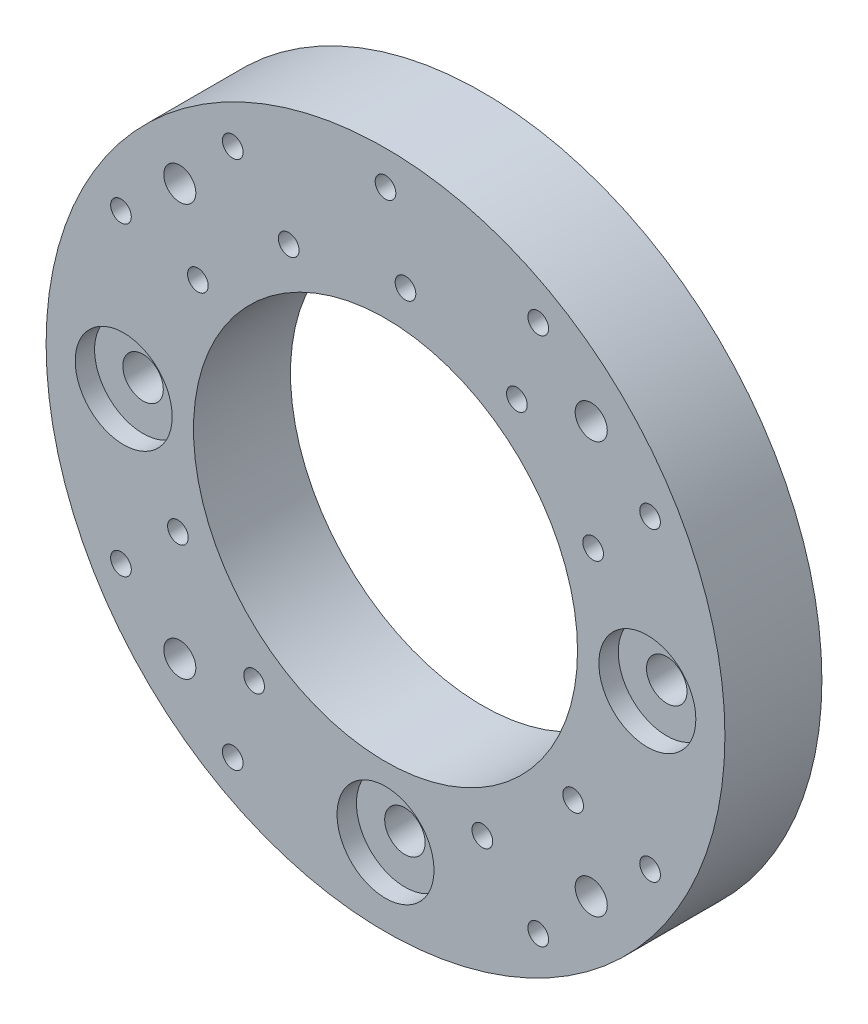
ISO-10303-21;
HEADER;
FILE_DESCRIPTION(('STEP AP214'),'2;1');
FILE_NAME('part.step','',(''),(''),'','','');
FILE_SCHEMA(('AUTOMOTIVE_DESIGN { 1 0 10303 214 1 1 1 1 }'));
ENDSEC;
DATA;
#1=APPLICATION_CONTEXT('core data for automotive mechanical design processes');
#2=APPLICATION_PROTOCOL_DEFINITION('international standard','automotive_design',2000,#1);
#3=PRODUCT_CONTEXT('',#1,'mechanical');
#4=PRODUCT('Part','Part','',(#3));
#5=PRODUCT_RELATED_PRODUCT_CATEGORY('part','',(#4));
#6=PRODUCT_DEFINITION_FORMATION('','',#4);
#7=PRODUCT_DEFINITION_CONTEXT('part definition',#1,'design');
#8=PRODUCT_DEFINITION('design','',#6,#7);
#9=PRODUCT_DEFINITION_SHAPE('','',#8);
#10=(LENGTH_UNIT() NAMED_UNIT(*) SI_UNIT(.MILLI.,.METRE.));
#11=(NAMED_UNIT(*) PLANE_ANGLE_UNIT() SI_UNIT($,.RADIAN.));
#12=(NAMED_UNIT(*) SI_UNIT($,.STERADIAN.) SOLID_ANGLE_UNIT());
#13=UNCERTAINTY_MEASURE_WITH_UNIT(LENGTH_MEASURE(1.E-05),#10,'distance_accuracy_value','');
#14=(GEOMETRIC_REPRESENTATION_CONTEXT(3) GLOBAL_UNCERTAINTY_ASSIGNED_CONTEXT((#13)) GLOBAL_UNIT_ASSIGNED_CONTEXT((#10,
#11,#12)) REPRESENTATION_CONTEXT('',''));
#15=CARTESIAN_POINT('',(0.,0.,0.));
#16=DIRECTION('',(0.,0.,1.));
#17=DIRECTION('',(1.,0.,0.));
#18=AXIS2_PLACEMENT_3D('',#15,#16,#17);
#19=CARTESIAN_POINT('',(0.,0.,12.7));
#20=DIRECTION('',(0.,0.,1.));
#21=DIRECTION('',(1.,0.,0.));
#22=AXIS2_PLACEMENT_3D('',#19,#20,#21);
#23=PLANE('',#22);
#24=CARTESIAN_POINT('',(20.0025000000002,34.6453462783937,12.7));
#25=DIRECTION('',(0.,0.,-1.));
#26=DIRECTION('',(-1.,0.,0.));
#27=AXIS2_PLACEMENT_3D('',#24,#25,#26);
#28=CIRCLE('',#27,1.35255);
#29=CARTESIAN_POINT('',(18.6499500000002,34.6453462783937,12.7));
#30=VERTEX_POINT('',#29);
#31=EDGE_CURVE('E215',#30,#30,#28,.T.);
#32=ORIENTED_EDGE('',*,*,#31,.T.);
#33=EDGE_LOOP('',(#32));
#34=FACE_BOUND('',#33,.T.);
#35=CARTESIAN_POINT('',(0.,40.005,12.7));
#36=DIRECTION('',(0.,0.,-1.));
#37=DIRECTION('',(-1.,0.,0.));
#38=AXIS2_PLACEMENT_3D('',#35,#36,#37);
#39=CIRCLE('',#38,1.35255);
#40=CARTESIAN_POINT('',(-1.35255,40.005,12.7));
#41=VERTEX_POINT('',#40);
#42=EDGE_CURVE('E227',#41,#41,#39,.T.);
#43=ORIENTED_EDGE('',*,*,#42,.T.);
#44=EDGE_LOOP('',(#43));
#45=FACE_BOUND('',#44,.T.);
#46=CARTESIAN_POINT('',(2.61444567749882,29.8832508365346,12.7));
#47=DIRECTION('',(0.,0.,-1.));
#48=DIRECTION('',(-1.,0.,0.));
#49=AXIS2_PLACEMENT_3D('',#46,#47,#48);
#50=CIRCLE('',#49,1.35255);
#51=CARTESIAN_POINT('',(1.26189567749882,29.8832508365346,12.7));
#52=VERTEX_POINT('',#51);
#53=EDGE_CURVE('E233',#52,#52,#50,.T.);
#54=ORIENTED_EDGE('',*,*,#53,.T.);
#55=EDGE_LOOP('',(#54));
#56=FACE_BOUND('',#55,.T.);
#57=CARTESIAN_POINT('',(-20.0025000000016,34.6453462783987,12.7));
#58=DIRECTION('',(0.,0.,-1.));
#59=DIRECTION('',(-1.,0.,0.));
#60=AXIS2_PLACEMENT_3D('',#57,#58,#59);
#61=CIRCLE('',#60,1.35255);
#62=CARTESIAN_POINT('',(-21.3550500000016,34.6453462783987,12.7));
#63=VERTEX_POINT('',#62);
#64=EDGE_CURVE('E239',#63,#63,#61,.T.);
#65=ORIENTED_EDGE('',*,*,#64,.T.);
#66=EDGE_LOOP('',(#65));
#67=FACE_BOUND('',#66,.T.);
#68=CARTESIAN_POINT('',(-24.5724315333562,17.2058017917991,12.7));
#69=DIRECTION('',(0.,0.,-1.));
#70=DIRECTION('',(-1.,0.,0.));
#71=AXIS2_PLACEMENT_3D('',#68,#69,#70);
#72=CIRCLE('',#71,1.35255);
#73=CARTESIAN_POINT('',(-25.9249815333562,17.2058017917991,12.7));
#74=VERTEX_POINT('',#73);
#75=EDGE_CURVE('E249',#74,#74,#72,.T.);
#76=ORIENTED_EDGE('',*,*,#75,.T.);
#77=EDGE_LOOP('',(#76));
#78=FACE_BOUND('',#77,.T.);
#79=CARTESIAN_POINT('',(-27.18687721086,-12.6774490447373,12.7));
#80=DIRECTION('',(0.,0.,-1.));
#81=DIRECTION('',(-1.,0.,0.));
#82=AXIS2_PLACEMENT_3D('',#79,#80,#81);
#83=CIRCLE('',#82,1.35255);
#84=CARTESIAN_POINT('',(-28.53942721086,-12.6774490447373,12.7));
#85=VERTEX_POINT('',#84);
#86=EDGE_CURVE('E261',#85,#85,#83,.T.);
#87=ORIENTED_EDGE('',*,*,#86,.T.);
#88=EDGE_LOOP('',(#87));
#89=FACE_BOUND('',#88,.T.);
#90=CARTESIAN_POINT('',(-34.6453462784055,-20.0024999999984,12.7));
#91=DIRECTION('',(0.,0.,-1.));
#92=DIRECTION('',(-1.,0.,0.));
#93=AXIS2_PLACEMENT_3D('',#90,#91,#92);
#94=CIRCLE('',#93,1.35254999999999);
#95=CARTESIAN_POINT('',(-35.9978962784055,-20.0024999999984,12.7));
#96=VERTEX_POINT('',#95);
#97=EDGE_CURVE('E265',#96,#96,#94,.T.);
#98=ORIENTED_EDGE('',*,*,#97,.T.);
#99=EDGE_LOOP('',(#98));
#100=FACE_BOUND('',#99,.T.);
#101=CARTESIAN_POINT('',(12.6774490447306,-27.1868772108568,12.7));
#102=DIRECTION('',(0.,0.,-1.));
#103=DIRECTION('',(-1.,0.,0.));
#104=AXIS2_PLACEMENT_3D('',#101,#102,#103);
#105=CIRCLE('',#104,1.35255);
#106=CARTESIAN_POINT('',(11.3248990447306,-27.1868772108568,12.7));
#107=VERTEX_POINT('',#106);
#108=EDGE_CURVE('E281',#107,#107,#105,.T.);
#109=ORIENTED_EDGE('',*,*,#108,.T.);
#110=EDGE_LOOP('',(#109));
#111=FACE_BOUND('',#110,.T.);
#112=CARTESIAN_POINT('',(20.0024999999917,-34.6453462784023,12.7));
#113=DIRECTION('',(0.,0.,-1.));
#114=DIRECTION('',(-1.,0.,0.));
#115=AXIS2_PLACEMENT_3D('',#112,#113,#114);
#116=CIRCLE('',#115,1.35255);
#117=CARTESIAN_POINT('',(18.6499499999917,-34.6453462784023,12.7));
#118=VERTEX_POINT('',#117);
#119=EDGE_CURVE('E287',#118,#118,#116,.T.);
#120=ORIENTED_EDGE('',*,*,#119,.T.);
#121=EDGE_LOOP('',(#120));
#122=FACE_BOUND('',#121,.T.);
#123=CARTESIAN_POINT('',(24.5724315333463,-17.2058017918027,12.7));
#124=DIRECTION('',(0.,0.,-1.));
#125=DIRECTION('',(-1.,0.,0.));
#126=AXIS2_PLACEMENT_3D('',#123,#124,#125);
#127=CIRCLE('',#126,1.35255);
#128=CARTESIAN_POINT('',(23.2198815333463,-17.2058017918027,12.7));
#129=VERTEX_POINT('',#128);
#130=EDGE_CURVE('E293',#129,#129,#127,.T.);
#131=ORIENTED_EDGE('',*,*,#130,.T.);
#132=EDGE_LOOP('',(#131));
#133=FACE_BOUND('',#132,.T.);
#134=CARTESIAN_POINT('',(34.6453462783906,-20.002500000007,12.7));
#135=DIRECTION('',(0.,0.,-1.));
#136=DIRECTION('',(-1.,0.,0.));
#137=AXIS2_PLACEMENT_3D('',#134,#135,#136);
#138=CIRCLE('',#137,1.35254999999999);
#139=CARTESIAN_POINT('',(33.2927962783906,-20.002500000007,12.7));
#140=VERTEX_POINT('',#139);
#141=EDGE_CURVE('E299',#140,#140,#138,.T.);
#142=ORIENTED_EDGE('',*,*,#141,.T.);
#143=EDGE_LOOP('',(#142));
#144=FACE_BOUND('',#143,.T.);
#145=CARTESIAN_POINT('',(27.1868772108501,12.6774490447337,12.7));
#146=DIRECTION('',(0.,0.,-1.));
#147=DIRECTION('',(-1.,0.,0.));
#148=AXIS2_PLACEMENT_3D('',#145,#146,#147);
#149=CIRCLE('',#148,1.35255);
#150=CARTESIAN_POINT('',(25.8343272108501,12.6774490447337,12.7));
#151=VERTEX_POINT('',#150);
#152=EDGE_CURVE('E305',#151,#151,#149,.T.);
#153=ORIENTED_EDGE('',*,*,#152,.T.);
#154=EDGE_LOOP('',(#153));
#155=FACE_BOUND('',#154,.T.);
#156=CARTESIAN_POINT('',(34.6453462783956,20.0024999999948,12.7));
#157=DIRECTION('',(0.,0.,-1.));
#158=DIRECTION('',(-1.,0.,0.));
#159=AXIS2_PLACEMENT_3D('',#156,#157,#158);
#160=CIRCLE('',#159,1.35254999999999);
#161=CARTESIAN_POINT('',(33.2927962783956,20.0024999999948,12.7));
#162=VERTEX_POINT('',#161);
#163=EDGE_CURVE('E81',#162,#162,#160,.T.);
#164=ORIENTED_EDGE('',*,*,#163,.T.);
#165=EDGE_LOOP('',(#164));
#166=FACE_BOUND('',#165,.T.);
#167=CARTESIAN_POINT('',(-26.9407683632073,26.9407683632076,12.7));
#168=DIRECTION('',(0.,0.,1.));
#169=DIRECTION('',(1.,0.,0.));
#170=AXIS2_PLACEMENT_3D('',#167,#168,#169);
#171=CIRCLE('',#170,2.1);
#172=CARTESIAN_POINT('',(-24.8407683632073,26.9407683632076,12.7));
#173=VERTEX_POINT('',#172);
#174=EDGE_CURVE('E75',#173,#173,#171,.T.);
#175=ORIENTED_EDGE('',*,*,#174,.F.);
#176=EDGE_LOOP('',(#175));
#177=FACE_BOUND('',#176,.T.);
#178=CARTESIAN_POINT('',(26.9407683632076,26.9407683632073,12.7));
#179=DIRECTION('',(0.,0.,1.));
#180=DIRECTION('',(1.,0.,0.));
#181=AXIS2_PLACEMENT_3D('',#178,#179,#180);
#182=CIRCLE('',#181,2.1);
#183=CARTESIAN_POINT('',(29.0407683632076,26.9407683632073,12.7));
#184=VERTEX_POINT('',#183);
#185=EDGE_CURVE('E74',#184,#184,#182,.T.);
#186=ORIENTED_EDGE('',*,*,#185,.F.);
#187=EDGE_LOOP('',(#186));
#188=FACE_BOUND('',#187,.T.);
#189=CARTESIAN_POINT('',(26.9407683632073,-26.9407683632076,12.7));
#190=DIRECTION('',(0.,0.,1.));
#191=DIRECTION('',(1.,0.,0.));
#192=AXIS2_PLACEMENT_3D('',#189,#190,#191);
#193=CIRCLE('',#192,2.1);
#194=CARTESIAN_POINT('',(29.0407683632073,-26.9407683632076,12.7));
#195=VERTEX_POINT('',#194);
#196=EDGE_CURVE('E87',#195,#195,#193,.T.);
#197=ORIENTED_EDGE('',*,*,#196,.F.);
#198=EDGE_LOOP('',(#197));
#199=FACE_BOUND('',#198,.T.);
#200=CARTESIAN_POINT('',(-26.9407683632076,-26.9407683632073,12.7));
#201=DIRECTION('',(0.,0.,1.));
#202=DIRECTION('',(1.,0.,0.));
#203=AXIS2_PLACEMENT_3D('',#200,#201,#202);
#204=CIRCLE('',#203,2.1);
#205=CARTESIAN_POINT('',(-24.8407683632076,-26.9407683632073,12.7));
#206=VERTEX_POINT('',#205);
#207=EDGE_CURVE('E93',#206,#206,#204,.T.);
#208=ORIENTED_EDGE('',*,*,#207,.F.);
#209=EDGE_LOOP('',(#208));
#210=FACE_BOUND('',#209,.T.);
#211=CARTESIAN_POINT('',(-34.29,0.,12.7));
#212=DIRECTION('',(0.,0.,1.));
#213=DIRECTION('',(1.,0.,0.));
#214=AXIS2_PLACEMENT_3D('',#211,#212,#213);
#215=CIRCLE('',#214,6.35);
#216=CARTESIAN_POINT('',(-27.94,0.,12.7));
#217=VERTEX_POINT('',#216);
#218=EDGE_CURVE('E104',#217,#217,#215,.T.);
#219=ORIENTED_EDGE('',*,*,#218,.F.);
#220=EDGE_LOOP('',(#219));
#221=FACE_BOUND('',#220,.T.);
#222=CARTESIAN_POINT('',(34.29,0.,12.7));
#223=DIRECTION('',(0.,0.,1.));
#224=DIRECTION('',(1.,0.,0.));
#225=AXIS2_PLACEMENT_3D('',#222,#223,#224);
#226=CIRCLE('',#225,6.35);
#227=CARTESIAN_POINT('',(40.64,0.,12.7));
#228=VERTEX_POINT('',#227);
#229=EDGE_CURVE('E110',#228,#228,#226,.T.);
#230=ORIENTED_EDGE('',*,*,#229,.F.);
#231=EDGE_LOOP('',(#230));
#232=FACE_BOUND('',#231,.T.);
#233=CARTESIAN_POINT('',(0.,-34.29,12.7));
#234=DIRECTION('',(0.,0.,1.));
#235=DIRECTION('',(1.,0.,0.));
#236=AXIS2_PLACEMENT_3D('',#233,#234,#235);
#237=CIRCLE('',#236,6.35);
#238=CARTESIAN_POINT('',(6.35,-34.29,12.7));
#239=VERTEX_POINT('',#238);
#240=EDGE_CURVE('E99',#239,#239,#237,.T.);
#241=ORIENTED_EDGE('',*,*,#240,.F.);
#242=EDGE_LOOP('',(#241));
#243=FACE_BOUND('',#242,.T.);
#244=CARTESIAN_POINT('',(0.,0.,12.7));
#245=DIRECTION('',(0.,0.,1.));
#246=DIRECTION('',(1.,0.,0.));
#247=AXIS2_PLACEMENT_3D('',#244,#245,#246);
#248=CIRCLE('',#247,44.45);
#249=CARTESIAN_POINT('',(44.45,0.,12.7));
#250=VERTEX_POINT('',#249);
#251=EDGE_CURVE('E11',#250,#250,#248,.T.);
#252=ORIENTED_EDGE('',*,*,#251,.T.);
#253=EDGE_LOOP('',(#252));
#254=FACE_BOUND('',#253,.T.);
#255=CARTESIAN_POINT('',(0.,0.,12.7));
#256=DIRECTION('',(0.,0.,1.));
#257=DIRECTION('',(1.,0.,0.));
#258=AXIS2_PLACEMENT_3D('',#255,#256,#257);
#259=CIRCLE('',#258,25.146);
#260=CARTESIAN_POINT('',(25.146,0.,12.7));
#261=VERTEX_POINT('',#260);
#262=EDGE_CURVE('E137',#261,#261,#259,.T.);
#263=ORIENTED_EDGE('',*,*,#262,.F.);
#264=EDGE_LOOP('',(#263));
#265=FACE_BOUND('',#264,.T.);
#266=CARTESIAN_POINT('',(-17.2058017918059,-24.5724315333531,12.7));
#267=DIRECTION('',(0.,0.,-1.));
#268=DIRECTION('',(-1.,0.,0.));
#269=AXIS2_PLACEMENT_3D('',#266,#267,#268);
#270=CIRCLE('',#269,1.35255);
#271=CARTESIAN_POINT('',(-18.5583517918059,-24.5724315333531,12.7));
#272=VERTEX_POINT('',#271);
#273=EDGE_CURVE('E275',#272,#272,#270,.T.);
#274=ORIENTED_EDGE('',*,*,#273,.T.);
#275=EDGE_LOOP('',(#274));
#276=FACE_BOUND('',#275,.T.);
#277=CARTESIAN_POINT('',(-20.0025000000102,-34.6453462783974,12.7));
#278=DIRECTION('',(0.,0.,-1.));
#279=DIRECTION('',(-1.,0.,0.));
#280=AXIS2_PLACEMENT_3D('',#277,#278,#279);
#281=CIRCLE('',#280,1.35255);
#282=CARTESIAN_POINT('',(-21.3550500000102,-34.6453462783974,12.7));
#283=VERTEX_POINT('',#282);
#284=EDGE_CURVE('E271',#283,#283,#281,.T.);
#285=ORIENTED_EDGE('',*,*,#284,.T.);
#286=EDGE_LOOP('',(#285));
#287=FACE_BOUND('',#286,.T.);
#288=CARTESIAN_POINT('',(-34.6453462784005,20.0025000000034,12.7));
#289=DIRECTION('',(0.,0.,-1.));
#290=DIRECTION('',(-1.,0.,0.));
#291=AXIS2_PLACEMENT_3D('',#288,#289,#290);
#292=CIRCLE('',#291,1.35254999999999);
#293=CARTESIAN_POINT('',(-35.9978962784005,20.0025000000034,12.7));
#294=VERTEX_POINT('',#293);
#295=EDGE_CURVE('E255',#294,#294,#292,.T.);
#296=ORIENTED_EDGE('',*,*,#295,.T.);
#297=EDGE_LOOP('',(#296));
#298=FACE_BOUND('',#297,.T.);
#299=CARTESIAN_POINT('',(-12.6774490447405,27.1868772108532,12.7));
#300=DIRECTION('',(0.,0.,-1.));
#301=DIRECTION('',(-1.,0.,0.));
#302=AXIS2_PLACEMENT_3D('',#299,#300,#301);
#303=CIRCLE('',#302,1.35255);
#304=CARTESIAN_POINT('',(-14.0299990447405,27.1868772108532,12.7));
#305=VERTEX_POINT('',#304);
#306=EDGE_CURVE('E245',#305,#305,#303,.T.);
#307=ORIENTED_EDGE('',*,*,#306,.T.);
#308=EDGE_LOOP('',(#307));
#309=FACE_BOUND('',#308,.T.);
#310=CARTESIAN_POINT('',(17.205801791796,24.5724315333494,12.7));
#311=DIRECTION('',(0.,0.,-1.));
#312=DIRECTION('',(-1.,0.,0.));
#313=AXIS2_PLACEMENT_3D('',#310,#311,#312);
#314=CIRCLE('',#313,1.35255);
#315=CARTESIAN_POINT('',(15.853251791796,24.5724315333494,12.7));
#316=VERTEX_POINT('',#315);
#317=EDGE_CURVE('E216',#316,#316,#314,.T.);
#318=ORIENTED_EDGE('',*,*,#317,.T.);
#319=EDGE_LOOP('',(#318));
#320=FACE_BOUND('',#319,.T.);
#321=ADVANCED_FACE('F41',(#34,#45,#56,#67,#78,#89,#100,#111,#122,#133,#144,#155,#166,#177,#188,
#199,#210,#221,#232,#243,#254,#265,#276,#287,#298,#309,#320),#23,.T.);
#322=CARTESIAN_POINT('',(0.,0.,0.));
#323=DIRECTION('',(0.,0.,1.));
#324=DIRECTION('',(1.,0.,0.));
#325=AXIS2_PLACEMENT_3D('',#322,#323,#324);
#326=PLANE('',#325);
#327=CARTESIAN_POINT('',(17.205801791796,24.5724315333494,0.));
#328=DIRECTION('',(0.,0.,-1.));
#329=DIRECTION('',(-1.,0.,0.));
#330=AXIS2_PLACEMENT_3D('',#327,#328,#329);
#331=CIRCLE('',#330,1.35254999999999);
#332=CARTESIAN_POINT('',(15.853251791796,24.5724315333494,0.));
#333=VERTEX_POINT('',#332);
#334=EDGE_CURVE('E221',#333,#333,#331,.T.);
#335=ORIENTED_EDGE('',*,*,#334,.F.);
#336=EDGE_LOOP('',(#335));
#337=FACE_BOUND('',#336,.T.);
#338=CARTESIAN_POINT('',(0.,40.005,0.));
#339=DIRECTION('',(0.,0.,-1.));
#340=DIRECTION('',(-1.,0.,0.));
#341=AXIS2_PLACEMENT_3D('',#338,#339,#340);
#342=CIRCLE('',#341,1.35254999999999);
#343=CARTESIAN_POINT('',(-1.35254999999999,40.005,0.));
#344=VERTEX_POINT('',#343);
#345=EDGE_CURVE('E218',#344,#344,#342,.T.);
#346=ORIENTED_EDGE('',*,*,#345,.F.);
#347=EDGE_LOOP('',(#346));
#348=FACE_BOUND('',#347,.T.);
#349=CARTESIAN_POINT('',(2.61444567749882,29.8832508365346,0.));
#350=DIRECTION('',(0.,0.,-1.));
#351=DIRECTION('',(-1.,0.,0.));
#352=AXIS2_PLACEMENT_3D('',#349,#350,#351);
#353=CIRCLE('',#352,1.35254999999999);
#354=CARTESIAN_POINT('',(1.26189567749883,29.8832508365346,0.));
#355=VERTEX_POINT('',#354);
#356=EDGE_CURVE('E230',#355,#355,#353,.T.);
#357=ORIENTED_EDGE('',*,*,#356,.F.);
#358=EDGE_LOOP('',(#357));
#359=FACE_BOUND('',#358,.T.);
#360=CARTESIAN_POINT('',(-20.0025000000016,34.6453462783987,0.));
#361=DIRECTION('',(0.,0.,-1.));
#362=DIRECTION('',(-1.,0.,0.));
#363=AXIS2_PLACEMENT_3D('',#360,#361,#362);
#364=CIRCLE('',#363,1.35254999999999);
#365=CARTESIAN_POINT('',(-21.3550500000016,34.6453462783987,0.));
#366=VERTEX_POINT('',#365);
#367=EDGE_CURVE('E236',#366,#366,#364,.T.);
#368=ORIENTED_EDGE('',*,*,#367,.F.);
#369=EDGE_LOOP('',(#368));
#370=FACE_BOUND('',#369,.T.);
#371=CARTESIAN_POINT('',(-12.6774490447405,27.1868772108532,0.));
#372=DIRECTION('',(0.,0.,-1.));
#373=DIRECTION('',(-1.,0.,0.));
#374=AXIS2_PLACEMENT_3D('',#371,#372,#373);
#375=CIRCLE('',#374,1.35254999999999);
#376=CARTESIAN_POINT('',(-14.0299990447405,27.1868772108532,0.));
#377=VERTEX_POINT('',#376);
#378=EDGE_CURVE('E242',#377,#377,#375,.T.);
#379=ORIENTED_EDGE('',*,*,#378,.F.);
#380=EDGE_LOOP('',(#379));
#381=FACE_BOUND('',#380,.T.);
#382=CARTESIAN_POINT('',(-34.6453462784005,20.0025000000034,0.));
#383=DIRECTION('',(0.,0.,-1.));
#384=DIRECTION('',(-1.,0.,0.));
#385=AXIS2_PLACEMENT_3D('',#382,#383,#384);
#386=CIRCLE('',#385,1.35254999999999);
#387=CARTESIAN_POINT('',(-35.9978962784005,20.0025000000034,0.));
#388=VERTEX_POINT('',#387);
#389=EDGE_CURVE('E252',#388,#388,#386,.T.);
#390=ORIENTED_EDGE('',*,*,#389,.F.);
#391=EDGE_LOOP('',(#390));
#392=FACE_BOUND('',#391,.T.);
#393=CARTESIAN_POINT('',(-27.18687721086,-12.6774490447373,0.));
#394=DIRECTION('',(0.,0.,-1.));
#395=DIRECTION('',(-1.,0.,0.));
#396=AXIS2_PLACEMENT_3D('',#393,#394,#395);
#397=CIRCLE('',#396,1.35254999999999);
#398=CARTESIAN_POINT('',(-28.5394272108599,-12.6774490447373,0.));
#399=VERTEX_POINT('',#398);
#400=EDGE_CURVE('E258',#399,#399,#397,.T.);
#401=ORIENTED_EDGE('',*,*,#400,.F.);
#402=EDGE_LOOP('',(#401));
#403=FACE_BOUND('',#402,.T.);
#404=CARTESIAN_POINT('',(-20.0025000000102,-34.6453462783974,0.));
#405=DIRECTION('',(0.,0.,-1.));
#406=DIRECTION('',(-1.,0.,0.));
#407=AXIS2_PLACEMENT_3D('',#404,#405,#406);
#408=CIRCLE('',#407,1.35254999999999);
#409=CARTESIAN_POINT('',(-21.3550500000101,-34.6453462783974,0.));
#410=VERTEX_POINT('',#409);
#411=EDGE_CURVE('E268',#410,#410,#408,.T.);
#412=ORIENTED_EDGE('',*,*,#411,.F.);
#413=EDGE_LOOP('',(#412));
#414=FACE_BOUND('',#413,.T.);
#415=CARTESIAN_POINT('',(12.6774490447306,-27.1868772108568,0.));
#416=DIRECTION('',(0.,0.,-1.));
#417=DIRECTION('',(-1.,0.,0.));
#418=AXIS2_PLACEMENT_3D('',#415,#416,#417);
#419=CIRCLE('',#418,1.35254999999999);
#420=CARTESIAN_POINT('',(11.3248990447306,-27.1868772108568,0.));
#421=VERTEX_POINT('',#420);
#422=EDGE_CURVE('E278',#421,#421,#419,.T.);
#423=ORIENTED_EDGE('',*,*,#422,.F.);
#424=EDGE_LOOP('',(#423));
#425=FACE_BOUND('',#424,.T.);
#426=CARTESIAN_POINT('',(20.0024999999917,-34.6453462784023,0.));
#427=DIRECTION('',(0.,0.,-1.));
#428=DIRECTION('',(-1.,0.,0.));
#429=AXIS2_PLACEMENT_3D('',#426,#427,#428);
#430=CIRCLE('',#429,1.35254999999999);
#431=CARTESIAN_POINT('',(18.6499499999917,-34.6453462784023,0.));
#432=VERTEX_POINT('',#431);
#433=EDGE_CURVE('E284',#432,#432,#430,.T.);
#434=ORIENTED_EDGE('',*,*,#433,.F.);
#435=EDGE_LOOP('',(#434));
#436=FACE_BOUND('',#435,.T.);
#437=CARTESIAN_POINT('',(24.5724315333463,-17.2058017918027,0.));
#438=DIRECTION('',(0.,0.,-1.));
#439=DIRECTION('',(-1.,0.,0.));
#440=AXIS2_PLACEMENT_3D('',#437,#438,#439);
#441=CIRCLE('',#440,1.35254999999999);
#442=CARTESIAN_POINT('',(23.2198815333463,-17.2058017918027,0.));
#443=VERTEX_POINT('',#442);
#444=EDGE_CURVE('E290',#443,#443,#441,.T.);
#445=ORIENTED_EDGE('',*,*,#444,.F.);
#446=EDGE_LOOP('',(#445));
#447=FACE_BOUND('',#446,.T.);
#448=CARTESIAN_POINT('',(34.6453462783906,-20.002500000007,0.));
#449=DIRECTION('',(0.,0.,-1.));
#450=DIRECTION('',(-1.,0.,0.));
#451=AXIS2_PLACEMENT_3D('',#448,#449,#450);
#452=CIRCLE('',#451,1.35254999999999);
#453=CARTESIAN_POINT('',(33.2927962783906,-20.002500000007,0.));
#454=VERTEX_POINT('',#453);
#455=EDGE_CURVE('E296',#454,#454,#452,.T.);
#456=ORIENTED_EDGE('',*,*,#455,.F.);
#457=EDGE_LOOP('',(#456));
#458=FACE_BOUND('',#457,.T.);
#459=CARTESIAN_POINT('',(27.1868772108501,12.6774490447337,0.));
#460=DIRECTION('',(0.,0.,-1.));
#461=DIRECTION('',(-1.,0.,0.));
#462=AXIS2_PLACEMENT_3D('',#459,#460,#461);
#463=CIRCLE('',#462,1.35254999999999);
#464=CARTESIAN_POINT('',(25.8343272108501,12.6774490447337,0.));
#465=VERTEX_POINT('',#464);
#466=EDGE_CURVE('E302',#465,#465,#463,.T.);
#467=ORIENTED_EDGE('',*,*,#466,.F.);
#468=EDGE_LOOP('',(#467));
#469=FACE_BOUND('',#468,.T.);
#470=CARTESIAN_POINT('',(34.6453462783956,20.0024999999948,0.));
#471=DIRECTION('',(0.,0.,-1.));
#472=DIRECTION('',(-1.,0.,0.));
#473=AXIS2_PLACEMENT_3D('',#470,#471,#472);
#474=CIRCLE('',#473,1.35254999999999);
#475=CARTESIAN_POINT('',(33.2927962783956,20.0024999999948,0.));
#476=VERTEX_POINT('',#475);
#477=EDGE_CURVE('E308',#476,#476,#474,.T.);
#478=ORIENTED_EDGE('',*,*,#477,.F.);
#479=EDGE_LOOP('',(#478));
#480=FACE_BOUND('',#479,.T.);
#481=CARTESIAN_POINT('',(0.,0.,0.));
#482=DIRECTION('',(0.,0.,1.));
#483=DIRECTION('',(1.,0.,0.));
#484=AXIS2_PLACEMENT_3D('',#481,#482,#483);
#485=CIRCLE('',#484,44.45);
#486=CARTESIAN_POINT('',(44.45,0.,0.));
#487=VERTEX_POINT('',#486);
#488=EDGE_CURVE('E50',#487,#487,#485,.T.);
#489=ORIENTED_EDGE('',*,*,#488,.F.);
#490=EDGE_LOOP('',(#489));
#491=FACE_BOUND('',#490,.T.);
#492=CARTESIAN_POINT('',(0.,0.,0.));
#493=DIRECTION('',(0.,0.,1.));
#494=DIRECTION('',(1.,0.,0.));
#495=AXIS2_PLACEMENT_3D('',#492,#493,#494);
#496=CIRCLE('',#495,25.146);
#497=CARTESIAN_POINT('',(25.146,0.,0.));
#498=VERTEX_POINT('',#497);
#499=EDGE_CURVE('E136',#498,#498,#496,.T.);
#500=ORIENTED_EDGE('',*,*,#499,.T.);
#501=EDGE_LOOP('',(#500));
#502=FACE_BOUND('',#501,.T.);
#503=CARTESIAN_POINT('',(-34.29,0.,0.));
#504=DIRECTION('',(0.,0.,-1.));
#505=DIRECTION('',(-1.,0.,0.));
#506=AXIS2_PLACEMENT_3D('',#503,#504,#505);
#507=CIRCLE('',#506,5.6);
#508=CARTESIAN_POINT('',(-39.89,0.,0.));
#509=VERTEX_POINT('',#508);
#510=EDGE_CURVE('E130',#509,#509,#507,.T.);
#511=ORIENTED_EDGE('',*,*,#510,.F.);
#512=EDGE_LOOP('',(#511));
#513=FACE_BOUND('',#512,.T.);
#514=CARTESIAN_POINT('',(0.,-34.29,0.));
#515=DIRECTION('',(0.,0.,-1.));
#516=DIRECTION('',(-1.,0.,0.));
#517=AXIS2_PLACEMENT_3D('',#514,#515,#516);
#518=CIRCLE('',#517,5.6);
#519=CARTESIAN_POINT('',(-5.6,-34.29,0.));
#520=VERTEX_POINT('',#519);
#521=EDGE_CURVE('E124',#520,#520,#518,.T.);
#522=ORIENTED_EDGE('',*,*,#521,.F.);
#523=EDGE_LOOP('',(#522));
#524=FACE_BOUND('',#523,.T.);
#525=CARTESIAN_POINT('',(34.29,0.,0.));
#526=DIRECTION('',(0.,0.,-1.));
#527=DIRECTION('',(-1.,0.,0.));
#528=AXIS2_PLACEMENT_3D('',#525,#526,#527);
#529=CIRCLE('',#528,5.6);
#530=CARTESIAN_POINT('',(28.69,0.,0.));
#531=VERTEX_POINT('',#530);
#532=EDGE_CURVE('E118',#531,#531,#529,.T.);
#533=ORIENTED_EDGE('',*,*,#532,.F.);
#534=EDGE_LOOP('',(#533));
#535=FACE_BOUND('',#534,.T.);
#536=CARTESIAN_POINT('',(-17.2058017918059,-24.5724315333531,0.));
#537=DIRECTION('',(0.,0.,-1.));
#538=DIRECTION('',(-1.,0.,0.));
#539=AXIS2_PLACEMENT_3D('',#536,#537,#538);
#540=CIRCLE('',#539,1.35254999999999);
#541=CARTESIAN_POINT('',(-18.5583517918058,-24.5724315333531,0.));
#542=VERTEX_POINT('',#541);
#543=EDGE_CURVE('E202',#542,#542,#540,.T.);
#544=ORIENTED_EDGE('',*,*,#543,.F.);
#545=EDGE_LOOP('',(#544));
#546=FACE_BOUND('',#545,.T.);
#547=CARTESIAN_POINT('',(-34.6453462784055,-20.0024999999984,0.));
#548=DIRECTION('',(0.,0.,-1.));
#549=DIRECTION('',(-1.,0.,0.));
#550=AXIS2_PLACEMENT_3D('',#547,#548,#549);
#551=CIRCLE('',#550,1.35254999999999);
#552=CARTESIAN_POINT('',(-35.9978962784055,-20.0024999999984,0.));
#553=VERTEX_POINT('',#552);
#554=EDGE_CURVE('E206',#553,#553,#551,.T.);
#555=ORIENTED_EDGE('',*,*,#554,.F.);
#556=EDGE_LOOP('',(#555));
#557=FACE_BOUND('',#556,.T.);
#558=CARTESIAN_POINT('',(-24.5724315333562,17.2058017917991,0.));
#559=DIRECTION('',(0.,0.,-1.));
#560=DIRECTION('',(-1.,0.,0.));
#561=AXIS2_PLACEMENT_3D('',#558,#559,#560);
#562=CIRCLE('',#561,1.35254999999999);
#563=CARTESIAN_POINT('',(-25.9249815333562,17.2058017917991,0.));
#564=VERTEX_POINT('',#563);
#565=EDGE_CURVE('E210',#564,#564,#562,.T.);
#566=ORIENTED_EDGE('',*,*,#565,.F.);
#567=EDGE_LOOP('',(#566));
#568=FACE_BOUND('',#567,.T.);
#569=CARTESIAN_POINT('',(20.0025000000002,34.6453462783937,0.));
#570=DIRECTION('',(0.,0.,-1.));
#571=DIRECTION('',(-1.,0.,0.));
#572=AXIS2_PLACEMENT_3D('',#569,#570,#571);
#573=CIRCLE('',#572,1.35254999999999);
#574=CARTESIAN_POINT('',(18.6499500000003,34.6453462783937,0.));
#575=VERTEX_POINT('',#574);
#576=EDGE_CURVE('E213',#575,#575,#573,.T.);
#577=ORIENTED_EDGE('',*,*,#576,.F.);
#578=EDGE_LOOP('',(#577));
#579=FACE_BOUND('',#578,.T.);
#580=ADVANCED_FACE('F157',(#337,#348,#359,#370,#381,#392,#403,#414,#425,#436,#447,#458,#469,
#480,#491,#502,#513,#524,#535,#546,#557,#568,#579),#326,.F.);
#581=CARTESIAN_POINT('',(-34.29,0.,0.));
#582=DIRECTION('',(0.,0.,-1.));
#583=DIRECTION('',(-1.,0.,0.));
#584=AXIS2_PLACEMENT_3D('',#581,#582,#583);
#585=CYLINDRICAL_SURFACE('',#584,2.65);
#586=CARTESIAN_POINT('',(-34.29,0.,2.95));
#587=DIRECTION('',(0.,0.,-1.));
#588=DIRECTION('',(-1.,0.,0.));
#589=AXIS2_PLACEMENT_3D('',#586,#587,#588);
#590=CIRCLE('',#589,2.65);
#591=CARTESIAN_POINT('',(-36.94,0.,2.95));
#592=VERTEX_POINT('',#591);
#593=EDGE_CURVE('E133',#592,#592,#590,.T.);
#594=ORIENTED_EDGE('',*,*,#593,.T.);
#595=EDGE_LOOP('',(#594));
#596=FACE_BOUND('',#595,.T.);
#597=CARTESIAN_POINT('',(-34.29,0.,10.16));
#598=DIRECTION('',(0.,0.,1.));
#599=DIRECTION('',(1.,0.,0.));
#600=AXIS2_PLACEMENT_3D('',#597,#598,#599);
#601=CIRCLE('',#600,2.65);
#602=CARTESIAN_POINT('',(-31.64,0.,10.16));
#603=VERTEX_POINT('',#602);
#604=EDGE_CURVE('E45',#603,#603,#601,.F.);
#605=ORIENTED_EDGE('',*,*,#604,.F.);
#606=EDGE_LOOP('',(#605));
#607=FACE_BOUND('',#606,.T.);
#608=ADVANCED_FACE('F154',(#596,#607),#585,.F.);
#609=CARTESIAN_POINT('',(0.,-34.29,0.));
#610=DIRECTION('',(0.,0.,-1.));
#611=DIRECTION('',(-1.,0.,0.));
#612=AXIS2_PLACEMENT_3D('',#609,#610,#611);
#613=CYLINDRICAL_SURFACE('',#612,2.65);
#614=CARTESIAN_POINT('',(0.,-34.29,2.95));
#615=DIRECTION('',(0.,0.,-1.));
#616=DIRECTION('',(-1.,0.,0.));
#617=AXIS2_PLACEMENT_3D('',#614,#615,#616);
#618=CIRCLE('',#617,2.65);
#619=CARTESIAN_POINT('',(-2.65,-34.29,2.95));
#620=VERTEX_POINT('',#619);
#621=EDGE_CURVE('E127',#620,#620,#618,.T.);
#622=ORIENTED_EDGE('',*,*,#621,.T.);
#623=EDGE_LOOP('',(#622));
#624=FACE_BOUND('',#623,.T.);
#625=CARTESIAN_POINT('',(0.,-34.29,10.16));
#626=DIRECTION('',(0.,0.,1.));
#627=DIRECTION('',(1.,0.,0.));
#628=AXIS2_PLACEMENT_3D('',#625,#626,#627);
#629=CIRCLE('',#628,2.65);
#630=CARTESIAN_POINT('',(2.64999999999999,-34.29,10.16));
#631=VERTEX_POINT('',#630);
#632=EDGE_CURVE('E145',#631,#631,#629,.F.);
#633=ORIENTED_EDGE('',*,*,#632,.F.);
#634=EDGE_LOOP('',(#633));
#635=FACE_BOUND('',#634,.T.);
#636=ADVANCED_FACE('F156',(#624,#635),#613,.F.);
#637=CARTESIAN_POINT('',(34.29,0.,0.));
#638=DIRECTION('',(0.,0.,-1.));
#639=DIRECTION('',(-1.,0.,0.));
#640=AXIS2_PLACEMENT_3D('',#637,#638,#639);
#641=CYLINDRICAL_SURFACE('',#640,2.65);
#642=CARTESIAN_POINT('',(34.29,0.,2.95));
#643=DIRECTION('',(0.,0.,-1.));
#644=DIRECTION('',(-1.,0.,0.));
#645=AXIS2_PLACEMENT_3D('',#642,#643,#644);
#646=CIRCLE('',#645,2.65);
#647=CARTESIAN_POINT('',(31.64,0.,2.95));
#648=VERTEX_POINT('',#647);
#649=EDGE_CURVE('E121',#648,#648,#646,.T.);
#650=ORIENTED_EDGE('',*,*,#649,.T.);
#651=EDGE_LOOP('',(#650));
#652=FACE_BOUND('',#651,.T.);
#653=CARTESIAN_POINT('',(34.29,0.,10.16));
#654=DIRECTION('',(0.,0.,1.));
#655=DIRECTION('',(1.,0.,0.));
#656=AXIS2_PLACEMENT_3D('',#653,#654,#655);
#657=CIRCLE('',#656,2.65);
#658=CARTESIAN_POINT('',(36.94,0.,10.16));
#659=VERTEX_POINT('',#658);
#660=EDGE_CURVE('E103',#659,#659,#657,.F.);
#661=ORIENTED_EDGE('',*,*,#660,.F.);
#662=EDGE_LOOP('',(#661));
#663=FACE_BOUND('',#662,.T.);
#664=ADVANCED_FACE('F164',(#652,#663),#641,.F.);
#665=CARTESIAN_POINT('',(0.,0.,12.7));
#666=DIRECTION('',(0.,0.,-1.));
#667=DIRECTION('',(-1.,0.,0.));
#668=AXIS2_PLACEMENT_3D('',#665,#666,#667);
#669=CYLINDRICAL_SURFACE('',#668,44.45);
#670=ORIENTED_EDGE('',*,*,#251,.F.);
#671=EDGE_LOOP('',(#670));
#672=FACE_BOUND('',#671,.T.);
#673=ORIENTED_EDGE('',*,*,#488,.T.);
#674=EDGE_LOOP('',(#673));
#675=FACE_BOUND('',#674,.T.);
#676=ADVANCED_FACE('F43',(#672,#675),#669,.T.);
#677=CARTESIAN_POINT('',(0.,0.,12.7));
#678=DIRECTION('',(0.,0.,-1.));
#679=DIRECTION('',(-1.,0.,0.));
#680=AXIS2_PLACEMENT_3D('',#677,#678,#679);
#681=CYLINDRICAL_SURFACE('',#680,25.146);
#682=ORIENTED_EDGE('',*,*,#262,.T.);
#683=EDGE_LOOP('',(#682));
#684=FACE_BOUND('',#683,.T.);
#685=ORIENTED_EDGE('',*,*,#499,.F.);
#686=EDGE_LOOP('',(#685));
#687=FACE_BOUND('',#686,.T.);
#688=ADVANCED_FACE('F177',(#684,#687),#681,.F.);
#689=CARTESIAN_POINT('',(-34.29,0.,0.));
#690=DIRECTION('',(0.,0.,-1.));
#691=DIRECTION('',(-1.,0.,0.));
#692=AXIS2_PLACEMENT_3D('',#689,#690,#691);
#693=CONICAL_SURFACE('',#692,5.6,0.785398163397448);
#694=ORIENTED_EDGE('',*,*,#593,.F.);
#695=EDGE_LOOP('',(#694));
#696=FACE_BOUND('',#695,.T.);
#697=ORIENTED_EDGE('',*,*,#510,.T.);
#698=EDGE_LOOP('',(#697));
#699=FACE_BOUND('',#698,.T.);
#700=ADVANCED_FACE('F179',(#696,#699),#693,.F.);
#701=CARTESIAN_POINT('',(0.,-34.29,0.));
#702=DIRECTION('',(0.,0.,-1.));
#703=DIRECTION('',(-1.,0.,0.));
#704=AXIS2_PLACEMENT_3D('',#701,#702,#703);
#705=CONICAL_SURFACE('',#704,5.6,0.785398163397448);
#706=ORIENTED_EDGE('',*,*,#621,.F.);
#707=EDGE_LOOP('',(#706));
#708=FACE_BOUND('',#707,.T.);
#709=ORIENTED_EDGE('',*,*,#521,.T.);
#710=EDGE_LOOP('',(#709));
#711=FACE_BOUND('',#710,.T.);
#712=ADVANCED_FACE('F185',(#708,#711),#705,.F.);
#713=CARTESIAN_POINT('',(34.29,0.,0.));
#714=DIRECTION('',(0.,0.,-1.));
#715=DIRECTION('',(-1.,0.,0.));
#716=AXIS2_PLACEMENT_3D('',#713,#714,#715);
#717=CONICAL_SURFACE('',#716,5.6,0.785398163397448);
#718=ORIENTED_EDGE('',*,*,#649,.F.);
#719=EDGE_LOOP('',(#718));
#720=FACE_BOUND('',#719,.T.);
#721=ORIENTED_EDGE('',*,*,#532,.T.);
#722=EDGE_LOOP('',(#721));
#723=FACE_BOUND('',#722,.T.);
#724=ADVANCED_FACE('F368',(#720,#723),#717,.F.);
#725=CARTESIAN_POINT('',(34.29,0.,10.16));
#726=DIRECTION('',(0.,0.,1.));
#727=DIRECTION('',(1.,0.,0.));
#728=AXIS2_PLACEMENT_3D('',#725,#726,#727);
#729=PLANE('',#728);
#730=CARTESIAN_POINT('',(34.29,0.,10.16));
#731=DIRECTION('',(0.,0.,1.));
#732=DIRECTION('',(1.,0.,0.));
#733=AXIS2_PLACEMENT_3D('',#730,#731,#732);
#734=CIRCLE('',#733,6.35);
#735=CARTESIAN_POINT('',(40.64,0.,10.16));
#736=VERTEX_POINT('',#735);
#737=EDGE_CURVE('E107',#736,#736,#734,.T.);
#738=ORIENTED_EDGE('',*,*,#737,.T.);
#739=EDGE_LOOP('',(#738));
#740=FACE_BOUND('',#739,.T.);
#741=ORIENTED_EDGE('',*,*,#660,.T.);
#742=EDGE_LOOP('',(#741));
#743=FACE_BOUND('',#742,.T.);
#744=ADVANCED_FACE('F364',(#740,#743),#729,.T.);
#745=CARTESIAN_POINT('',(34.29,0.,10.16));
#746=DIRECTION('',(0.,0.,1.));
#747=DIRECTION('',(1.,0.,0.));
#748=AXIS2_PLACEMENT_3D('',#745,#746,#747);
#749=CYLINDRICAL_SURFACE('',#748,6.35);
#750=ORIENTED_EDGE('',*,*,#737,.F.);
#751=EDGE_LOOP('',(#750));
#752=FACE_BOUND('',#751,.T.);
#753=ORIENTED_EDGE('',*,*,#229,.T.);
#754=EDGE_LOOP('',(#753));
#755=FACE_BOUND('',#754,.T.);
#756=ADVANCED_FACE('F367',(#752,#755),#749,.F.);
#757=CARTESIAN_POINT('',(0.,-34.29,10.16));
#758=DIRECTION('',(0.,0.,1.));
#759=DIRECTION('',(1.,0.,0.));
#760=AXIS2_PLACEMENT_3D('',#757,#758,#759);
#761=PLANE('',#760);
#762=CARTESIAN_POINT('',(0.,-34.29,10.16));
#763=DIRECTION('',(0.,0.,1.));
#764=DIRECTION('',(1.,0.,0.));
#765=AXIS2_PLACEMENT_3D('',#762,#763,#764);
#766=CIRCLE('',#765,6.35);
#767=CARTESIAN_POINT('',(6.35,-34.29,10.16));
#768=VERTEX_POINT('',#767);
#769=EDGE_CURVE('E113',#768,#768,#766,.T.);
#770=ORIENTED_EDGE('',*,*,#769,.T.);
#771=EDGE_LOOP('',(#770));
#772=FACE_BOUND('',#771,.T.);
#773=ORIENTED_EDGE('',*,*,#632,.T.);
#774=EDGE_LOOP('',(#773));
#775=FACE_BOUND('',#774,.T.);
#776=ADVANCED_FACE('F372',(#772,#775),#761,.T.);
#777=CARTESIAN_POINT('',(0.,-34.29,10.16));
#778=DIRECTION('',(0.,0.,1.));
#779=DIRECTION('',(1.,0.,0.));
#780=AXIS2_PLACEMENT_3D('',#777,#778,#779);
#781=CYLINDRICAL_SURFACE('',#780,6.35);
#782=ORIENTED_EDGE('',*,*,#769,.F.);
#783=EDGE_LOOP('',(#782));
#784=FACE_BOUND('',#783,.T.);
#785=ORIENTED_EDGE('',*,*,#240,.T.);
#786=EDGE_LOOP('',(#785));
#787=FACE_BOUND('',#786,.T.);
#788=ADVANCED_FACE('F359',(#784,#787),#781,.F.);
#789=CARTESIAN_POINT('',(-34.29,0.,10.16));
#790=DIRECTION('',(0.,0.,1.));
#791=DIRECTION('',(1.,0.,0.));
#792=AXIS2_PLACEMENT_3D('',#789,#790,#791);
#793=PLANE('',#792);
#794=CARTESIAN_POINT('',(-34.29,0.,10.16));
#795=DIRECTION('',(0.,0.,1.));
#796=DIRECTION('',(1.,0.,0.));
#797=AXIS2_PLACEMENT_3D('',#794,#795,#796);
#798=CIRCLE('',#797,6.35);
#799=CARTESIAN_POINT('',(-27.94,0.,10.16));
#800=VERTEX_POINT('',#799);
#801=EDGE_CURVE('E100',#800,#800,#798,.T.);
#802=ORIENTED_EDGE('',*,*,#801,.T.);
#803=EDGE_LOOP('',(#802));
#804=FACE_BOUND('',#803,.T.);
#805=ORIENTED_EDGE('',*,*,#604,.T.);
#806=EDGE_LOOP('',(#805));
#807=FACE_BOUND('',#806,.T.);
#808=ADVANCED_FACE('F152',(#804,#807),#793,.T.);
#809=CARTESIAN_POINT('',(-34.29,0.,10.16));
#810=DIRECTION('',(0.,0.,1.));
#811=DIRECTION('',(1.,0.,0.));
#812=AXIS2_PLACEMENT_3D('',#809,#810,#811);
#813=CYLINDRICAL_SURFACE('',#812,6.35);
#814=ORIENTED_EDGE('',*,*,#801,.F.);
#815=EDGE_LOOP('',(#814));
#816=FACE_BOUND('',#815,.T.);
#817=ORIENTED_EDGE('',*,*,#218,.T.);
#818=EDGE_LOOP('',(#817));
#819=FACE_BOUND('',#818,.T.);
#820=ADVANCED_FACE('F356',(#816,#819),#813,.F.);
#821=CARTESIAN_POINT('',(-26.9407683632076,-26.9407683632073,3.175));
#822=DIRECTION('',(0.,0.,1.));
#823=DIRECTION('',(1.,0.,0.));
#824=AXIS2_PLACEMENT_3D('',#821,#822,#823);
#825=CONICAL_SURFACE('',#824,2.1,1.02974425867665);
#826=CARTESIAN_POINT('',(-26.9407683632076,-26.9407683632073,1.91319270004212));
#827=VERTEX_POINT('',#826);
#828=VERTEX_LOOP('',#827);
#829=FACE_BOUND('',#828,.T.);
#830=CARTESIAN_POINT('',(-26.9407683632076,-26.9407683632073,3.175));
#831=DIRECTION('',(0.,0.,1.));
#832=DIRECTION('',(1.,0.,0.));
#833=AXIS2_PLACEMENT_3D('',#830,#831,#832);
#834=CIRCLE('',#833,2.1);
#835=CARTESIAN_POINT('',(-24.8407683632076,-26.9407683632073,3.175));
#836=VERTEX_POINT('',#835);
#837=EDGE_CURVE('E96',#836,#836,#834,.T.);
#838=ORIENTED_EDGE('',*,*,#837,.T.);
#839=EDGE_LOOP('',(#838));
#840=FACE_BOUND('',#839,.T.);
#841=ADVANCED_FACE('F352',(#829,#840),#825,.F.);
#842=CARTESIAN_POINT('',(-26.9407683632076,-26.9407683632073,12.7));
#843=DIRECTION('',(0.,0.,1.));
#844=DIRECTION('',(1.,0.,0.));
#845=AXIS2_PLACEMENT_3D('',#842,#843,#844);
#846=CYLINDRICAL_SURFACE('',#845,2.1);
#847=ORIENTED_EDGE('',*,*,#837,.F.);
#848=EDGE_LOOP('',(#847));
#849=FACE_BOUND('',#848,.T.);
#850=ORIENTED_EDGE('',*,*,#207,.T.);
#851=EDGE_LOOP('',(#850));
#852=FACE_BOUND('',#851,.T.);
#853=ADVANCED_FACE('F349',(#849,#852),#846,.F.);
#854=CARTESIAN_POINT('',(26.9407683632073,-26.9407683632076,3.175));
#855=DIRECTION('',(0.,0.,1.));
#856=DIRECTION('',(1.,0.,0.));
#857=AXIS2_PLACEMENT_3D('',#854,#855,#856);
#858=CONICAL_SURFACE('',#857,2.1,1.02974425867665);
#859=CARTESIAN_POINT('',(26.9407683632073,-26.9407683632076,1.91319270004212));
#860=VERTEX_POINT('',#859);
#861=VERTEX_LOOP('',#860);
#862=FACE_BOUND('',#861,.T.);
#863=CARTESIAN_POINT('',(26.9407683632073,-26.9407683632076,3.175));
#864=DIRECTION('',(0.,0.,1.));
#865=DIRECTION('',(1.,0.,0.));
#866=AXIS2_PLACEMENT_3D('',#863,#864,#865);
#867=CIRCLE('',#866,2.1);
#868=CARTESIAN_POINT('',(29.0407683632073,-26.9407683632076,3.175));
#869=VERTEX_POINT('',#868);
#870=EDGE_CURVE('E90',#869,#869,#867,.T.);
#871=ORIENTED_EDGE('',*,*,#870,.T.);
#872=EDGE_LOOP('',(#871));
#873=FACE_BOUND('',#872,.T.);
#874=ADVANCED_FACE('F345',(#862,#873),#858,.F.);
#875=CARTESIAN_POINT('',(26.9407683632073,-26.9407683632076,12.7));
#876=DIRECTION('',(0.,0.,1.));
#877=DIRECTION('',(1.,0.,0.));
#878=AXIS2_PLACEMENT_3D('',#875,#876,#877);
#879=CYLINDRICAL_SURFACE('',#878,2.1);
#880=ORIENTED_EDGE('',*,*,#870,.F.);
#881=EDGE_LOOP('',(#880));
#882=FACE_BOUND('',#881,.T.);
#883=ORIENTED_EDGE('',*,*,#196,.T.);
#884=EDGE_LOOP('',(#883));
#885=FACE_BOUND('',#884,.T.);
#886=ADVANCED_FACE('F341',(#882,#885),#879,.F.);
#887=CARTESIAN_POINT('',(26.9407683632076,26.9407683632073,3.175));
#888=DIRECTION('',(0.,0.,1.));
#889=DIRECTION('',(1.,0.,0.));
#890=AXIS2_PLACEMENT_3D('',#887,#888,#889);
#891=CONICAL_SURFACE('',#890,2.1,1.02974425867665);
#892=CARTESIAN_POINT('',(26.9407683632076,26.9407683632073,1.91319270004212));
#893=VERTEX_POINT('',#892);
#894=VERTEX_LOOP('',#893);
#895=FACE_BOUND('',#894,.T.);
#896=CARTESIAN_POINT('',(26.9407683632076,26.9407683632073,3.175));
#897=DIRECTION('',(0.,0.,1.));
#898=DIRECTION('',(1.,0.,0.));
#899=AXIS2_PLACEMENT_3D('',#896,#897,#898);
#900=CIRCLE('',#899,2.1);
#901=CARTESIAN_POINT('',(29.0407683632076,26.9407683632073,3.175));
#902=VERTEX_POINT('',#901);
#903=EDGE_CURVE('E78',#902,#902,#900,.T.);
#904=ORIENTED_EDGE('',*,*,#903,.T.);
#905=EDGE_LOOP('',(#904));
#906=FACE_BOUND('',#905,.T.);
#907=ADVANCED_FACE('F337',(#895,#906),#891,.F.);
#908=CARTESIAN_POINT('',(26.9407683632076,26.9407683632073,12.7));
#909=DIRECTION('',(0.,0.,1.));
#910=DIRECTION('',(1.,0.,0.));
#911=AXIS2_PLACEMENT_3D('',#908,#909,#910);
#912=CYLINDRICAL_SURFACE('',#911,2.1);
#913=ORIENTED_EDGE('',*,*,#903,.F.);
#914=EDGE_LOOP('',(#913));
#915=FACE_BOUND('',#914,.T.);
#916=ORIENTED_EDGE('',*,*,#185,.T.);
#917=EDGE_LOOP('',(#916));
#918=FACE_BOUND('',#917,.T.);
#919=ADVANCED_FACE('F68',(#915,#918),#912,.F.);
#920=CARTESIAN_POINT('',(-26.9407683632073,26.9407683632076,3.175));
#921=DIRECTION('',(0.,0.,1.));
#922=DIRECTION('',(1.,0.,0.));
#923=AXIS2_PLACEMENT_3D('',#920,#921,#922);
#924=CONICAL_SURFACE('',#923,2.1,1.02974425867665);
#925=CARTESIAN_POINT('',(-26.9407683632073,26.9407683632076,1.91319270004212));
#926=VERTEX_POINT('',#925);
#927=VERTEX_LOOP('',#926);
#928=FACE_BOUND('',#927,.T.);
#929=CARTESIAN_POINT('',(-26.9407683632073,26.9407683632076,3.175));
#930=DIRECTION('',(0.,0.,1.));
#931=DIRECTION('',(1.,0.,0.));
#932=AXIS2_PLACEMENT_3D('',#929,#930,#931);
#933=CIRCLE('',#932,2.1);
#934=CARTESIAN_POINT('',(-24.8407683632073,26.9407683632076,3.175));
#935=VERTEX_POINT('',#934);
#936=EDGE_CURVE('E72',#935,#935,#933,.T.);
#937=ORIENTED_EDGE('',*,*,#936,.T.);
#938=EDGE_LOOP('',(#937));
#939=FACE_BOUND('',#938,.T.);
#940=ADVANCED_FACE('F64',(#928,#939),#924,.F.);
#941=CARTESIAN_POINT('',(-26.9407683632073,26.9407683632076,12.7));
#942=DIRECTION('',(0.,0.,1.));
#943=DIRECTION('',(1.,0.,0.));
#944=AXIS2_PLACEMENT_3D('',#941,#942,#943);
#945=CYLINDRICAL_SURFACE('',#944,2.1);
#946=ORIENTED_EDGE('',*,*,#936,.F.);
#947=EDGE_LOOP('',(#946));
#948=FACE_BOUND('',#947,.T.);
#949=ORIENTED_EDGE('',*,*,#174,.T.);
#950=EDGE_LOOP('',(#949));
#951=FACE_BOUND('',#950,.T.);
#952=ADVANCED_FACE('F67',(#948,#951),#945,.F.);
#953=CARTESIAN_POINT('',(34.6453462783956,20.0024999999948,0.));
#954=DIRECTION('',(0.,0.,-1.));
#955=DIRECTION('',(-1.,0.,0.));
#956=AXIS2_PLACEMENT_3D('',#953,#954,#955);
#957=CYLINDRICAL_SURFACE('',#956,1.35254999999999);
#958=ORIENTED_EDGE('',*,*,#163,.F.);
#959=EDGE_LOOP('',(#958));
#960=FACE_BOUND('',#959,.T.);
#961=ORIENTED_EDGE('',*,*,#477,.T.);
#962=EDGE_LOOP('',(#961));
#963=FACE_BOUND('',#962,.T.);
#964=ADVANCED_FACE('F315',(#960,#963),#957,.F.);
#965=CARTESIAN_POINT('',(27.1868772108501,12.6774490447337,0.));
#966=DIRECTION('',(0.,0.,-1.));
#967=DIRECTION('',(-1.,0.,0.));
#968=AXIS2_PLACEMENT_3D('',#965,#966,#967);
#969=CYLINDRICAL_SURFACE('',#968,1.35254999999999);
#970=ORIENTED_EDGE('',*,*,#152,.F.);
#971=EDGE_LOOP('',(#970));
#972=FACE_BOUND('',#971,.T.);
#973=ORIENTED_EDGE('',*,*,#466,.T.);
#974=EDGE_LOOP('',(#973));
#975=FACE_BOUND('',#974,.T.);
#976=ADVANCED_FACE('F318',(#972,#975),#969,.F.);
#977=CARTESIAN_POINT('',(34.6453462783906,-20.002500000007,0.));
#978=DIRECTION('',(0.,0.,-1.));
#979=DIRECTION('',(-1.,0.,0.));
#980=AXIS2_PLACEMENT_3D('',#977,#978,#979);
#981=CYLINDRICAL_SURFACE('',#980,1.35254999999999);
#982=ORIENTED_EDGE('',*,*,#141,.F.);
#983=EDGE_LOOP('',(#982));
#984=FACE_BOUND('',#983,.T.);
#985=ORIENTED_EDGE('',*,*,#455,.T.);
#986=EDGE_LOOP('',(#985));
#987=FACE_BOUND('',#986,.T.);
#988=ADVANCED_FACE('F329',(#984,#987),#981,.F.);
#989=CARTESIAN_POINT('',(24.5724315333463,-17.2058017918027,0.));
#990=DIRECTION('',(0.,0.,-1.));
#991=DIRECTION('',(-1.,0.,0.));
#992=AXIS2_PLACEMENT_3D('',#989,#990,#991);
#993=CYLINDRICAL_SURFACE('',#992,1.35254999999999);
#994=ORIENTED_EDGE('',*,*,#130,.F.);
#995=EDGE_LOOP('',(#994));
#996=FACE_BOUND('',#995,.T.);
#997=ORIENTED_EDGE('',*,*,#444,.T.);
#998=EDGE_LOOP('',(#997));
#999=FACE_BOUND('',#998,.T.);
#1000=ADVANCED_FACE('F510',(#996,#999),#993,.F.);
#1001=CARTESIAN_POINT('',(20.0024999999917,-34.6453462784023,0.));
#1002=DIRECTION('',(0.,0.,-1.));
#1003=DIRECTION('',(-1.,0.,0.));
#1004=AXIS2_PLACEMENT_3D('',#1001,#1002,#1003);
#1005=CYLINDRICAL_SURFACE('',#1004,1.35254999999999);
#1006=ORIENTED_EDGE('',*,*,#119,.F.);
#1007=EDGE_LOOP('',(#1006));
#1008=FACE_BOUND('',#1007,.T.);
#1009=ORIENTED_EDGE('',*,*,#433,.T.);
#1010=EDGE_LOOP('',(#1009));
#1011=FACE_BOUND('',#1010,.T.);
#1012=ADVANCED_FACE('F520',(#1008,#1011),#1005,.F.);
#1013=CARTESIAN_POINT('',(12.6774490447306,-27.1868772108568,0.));
#1014=DIRECTION('',(0.,0.,-1.));
#1015=DIRECTION('',(-1.,0.,0.));
#1016=AXIS2_PLACEMENT_3D('',#1013,#1014,#1015);
#1017=CYLINDRICAL_SURFACE('',#1016,1.35254999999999);
#1018=ORIENTED_EDGE('',*,*,#108,.F.);
#1019=EDGE_LOOP('',(#1018));
#1020=FACE_BOUND('',#1019,.T.);
#1021=ORIENTED_EDGE('',*,*,#422,.T.);
#1022=EDGE_LOOP('',(#1021));
#1023=FACE_BOUND('',#1022,.T.);
#1024=ADVANCED_FACE('F531',(#1020,#1023),#1017,.F.);
#1025=CARTESIAN_POINT('',(-17.2058017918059,-24.5724315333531,0.));
#1026=DIRECTION('',(0.,0.,-1.));
#1027=DIRECTION('',(-1.,0.,0.));
#1028=AXIS2_PLACEMENT_3D('',#1025,#1026,#1027);
#1029=CYLINDRICAL_SURFACE('',#1028,1.35254999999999);
#1030=ORIENTED_EDGE('',*,*,#273,.F.);
#1031=EDGE_LOOP('',(#1030));
#1032=FACE_BOUND('',#1031,.T.);
#1033=ORIENTED_EDGE('',*,*,#543,.T.);
#1034=EDGE_LOOP('',(#1033));
#1035=FACE_BOUND('',#1034,.T.);
#1036=ADVANCED_FACE('F542',(#1032,#1035),#1029,.F.);
#1037=CARTESIAN_POINT('',(-20.0025000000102,-34.6453462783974,0.));
#1038=DIRECTION('',(0.,0.,-1.));
#1039=DIRECTION('',(-1.,0.,0.));
#1040=AXIS2_PLACEMENT_3D('',#1037,#1038,#1039);
#1041=CYLINDRICAL_SURFACE('',#1040,1.35254999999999);
#1042=ORIENTED_EDGE('',*,*,#284,.F.);
#1043=EDGE_LOOP('',(#1042));
#1044=FACE_BOUND('',#1043,.T.);
#1045=ORIENTED_EDGE('',*,*,#411,.T.);
#1046=EDGE_LOOP('',(#1045));
#1047=FACE_BOUND('',#1046,.T.);
#1048=ADVANCED_FACE('F553',(#1044,#1047),#1041,.F.);
#1049=CARTESIAN_POINT('',(-34.6453462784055,-20.0024999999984,0.));
#1050=DIRECTION('',(0.,0.,-1.));
#1051=DIRECTION('',(-1.,0.,0.));
#1052=AXIS2_PLACEMENT_3D('',#1049,#1050,#1051);
#1053=CYLINDRICAL_SURFACE('',#1052,1.35254999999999);
#1054=ORIENTED_EDGE('',*,*,#97,.F.);
#1055=EDGE_LOOP('',(#1054));
#1056=FACE_BOUND('',#1055,.T.);
#1057=ORIENTED_EDGE('',*,*,#554,.T.);
#1058=EDGE_LOOP('',(#1057));
#1059=FACE_BOUND('',#1058,.T.);
#1060=ADVANCED_FACE('F564',(#1056,#1059),#1053,.F.);
#1061=CARTESIAN_POINT('',(-27.18687721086,-12.6774490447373,0.));
#1062=DIRECTION('',(0.,0.,-1.));
#1063=DIRECTION('',(-1.,0.,0.));
#1064=AXIS2_PLACEMENT_3D('',#1061,#1062,#1063);
#1065=CYLINDRICAL_SURFACE('',#1064,1.35254999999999);
#1066=ORIENTED_EDGE('',*,*,#86,.F.);
#1067=EDGE_LOOP('',(#1066));
#1068=FACE_BOUND('',#1067,.T.);
#1069=ORIENTED_EDGE('',*,*,#400,.T.);
#1070=EDGE_LOOP('',(#1069));
#1071=FACE_BOUND('',#1070,.T.);
#1072=ADVANCED_FACE('F575',(#1068,#1071),#1065,.F.);
#1073=CARTESIAN_POINT('',(-34.6453462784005,20.0025000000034,0.));
#1074=DIRECTION('',(0.,0.,-1.));
#1075=DIRECTION('',(-1.,0.,0.));
#1076=AXIS2_PLACEMENT_3D('',#1073,#1074,#1075);
#1077=CYLINDRICAL_SURFACE('',#1076,1.35254999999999);
#1078=ORIENTED_EDGE('',*,*,#295,.F.);
#1079=EDGE_LOOP('',(#1078));
#1080=FACE_BOUND('',#1079,.T.);
#1081=ORIENTED_EDGE('',*,*,#389,.T.);
#1082=EDGE_LOOP('',(#1081));
#1083=FACE_BOUND('',#1082,.T.);
#1084=ADVANCED_FACE('F586',(#1080,#1083),#1077,.F.);
#1085=CARTESIAN_POINT('',(-24.5724315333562,17.2058017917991,0.));
#1086=DIRECTION('',(0.,0.,-1.));
#1087=DIRECTION('',(-1.,0.,0.));
#1088=AXIS2_PLACEMENT_3D('',#1085,#1086,#1087);
#1089=CYLINDRICAL_SURFACE('',#1088,1.35254999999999);
#1090=ORIENTED_EDGE('',*,*,#75,.F.);
#1091=EDGE_LOOP('',(#1090));
#1092=FACE_BOUND('',#1091,.T.);
#1093=ORIENTED_EDGE('',*,*,#565,.T.);
#1094=EDGE_LOOP('',(#1093));
#1095=FACE_BOUND('',#1094,.T.);
#1096=ADVANCED_FACE('F597',(#1092,#1095),#1089,.F.);
#1097=CARTESIAN_POINT('',(-12.6774490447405,27.1868772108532,0.));
#1098=DIRECTION('',(0.,0.,-1.));
#1099=DIRECTION('',(-1.,0.,0.));
#1100=AXIS2_PLACEMENT_3D('',#1097,#1098,#1099);
#1101=CYLINDRICAL_SURFACE('',#1100,1.35254999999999);
#1102=ORIENTED_EDGE('',*,*,#306,.F.);
#1103=EDGE_LOOP('',(#1102));
#1104=FACE_BOUND('',#1103,.T.);
#1105=ORIENTED_EDGE('',*,*,#378,.T.);
#1106=EDGE_LOOP('',(#1105));
#1107=FACE_BOUND('',#1106,.T.);
#1108=ADVANCED_FACE('F608',(#1104,#1107),#1101,.F.);
#1109=CARTESIAN_POINT('',(-20.0025000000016,34.6453462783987,0.));
#1110=DIRECTION('',(0.,0.,-1.));
#1111=DIRECTION('',(-1.,0.,0.));
#1112=AXIS2_PLACEMENT_3D('',#1109,#1110,#1111);
#1113=CYLINDRICAL_SURFACE('',#1112,1.35254999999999);
#1114=ORIENTED_EDGE('',*,*,#64,.F.);
#1115=EDGE_LOOP('',(#1114));
#1116=FACE_BOUND('',#1115,.T.);
#1117=ORIENTED_EDGE('',*,*,#367,.T.);
#1118=EDGE_LOOP('',(#1117));
#1119=FACE_BOUND('',#1118,.T.);
#1120=ADVANCED_FACE('F619',(#1116,#1119),#1113,.F.);
#1121=CARTESIAN_POINT('',(2.61444567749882,29.8832508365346,0.));
#1122=DIRECTION('',(0.,0.,-1.));
#1123=DIRECTION('',(-1.,0.,0.));
#1124=AXIS2_PLACEMENT_3D('',#1121,#1122,#1123);
#1125=CYLINDRICAL_SURFACE('',#1124,1.35254999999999);
#1126=ORIENTED_EDGE('',*,*,#53,.F.);
#1127=EDGE_LOOP('',(#1126));
#1128=FACE_BOUND('',#1127,.T.);
#1129=ORIENTED_EDGE('',*,*,#356,.T.);
#1130=EDGE_LOOP('',(#1129));
#1131=FACE_BOUND('',#1130,.T.);
#1132=ADVANCED_FACE('F630',(#1128,#1131),#1125,.F.);
#1133=CARTESIAN_POINT('',(0.,40.005,0.));
#1134=DIRECTION('',(0.,0.,-1.));
#1135=DIRECTION('',(-1.,0.,0.));
#1136=AXIS2_PLACEMENT_3D('',#1133,#1134,#1135);
#1137=CYLINDRICAL_SURFACE('',#1136,1.35254999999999);
#1138=ORIENTED_EDGE('',*,*,#42,.F.);
#1139=EDGE_LOOP('',(#1138));
#1140=FACE_BOUND('',#1139,.T.);
#1141=ORIENTED_EDGE('',*,*,#345,.T.);
#1142=EDGE_LOOP('',(#1141));
#1143=FACE_BOUND('',#1142,.T.);
#1144=ADVANCED_FACE('F641',(#1140,#1143),#1137,.F.);
#1145=CARTESIAN_POINT('',(20.0025000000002,34.6453462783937,0.));
#1146=DIRECTION('',(0.,0.,-1.));
#1147=DIRECTION('',(-1.,0.,0.));
#1148=AXIS2_PLACEMENT_3D('',#1145,#1146,#1147);
#1149=CYLINDRICAL_SURFACE('',#1148,1.35254999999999);
#1150=ORIENTED_EDGE('',*,*,#31,.F.);
#1151=EDGE_LOOP('',(#1150));
#1152=FACE_BOUND('',#1151,.T.);
#1153=ORIENTED_EDGE('',*,*,#576,.T.);
#1154=EDGE_LOOP('',(#1153));
#1155=FACE_BOUND('',#1154,.T.);
#1156=ADVANCED_FACE('F652',(#1152,#1155),#1149,.F.);
#1157=CARTESIAN_POINT('',(17.205801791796,24.5724315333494,0.));
#1158=DIRECTION('',(0.,0.,-1.));
#1159=DIRECTION('',(-1.,0.,0.));
#1160=AXIS2_PLACEMENT_3D('',#1157,#1158,#1159);
#1161=CYLINDRICAL_SURFACE('',#1160,1.35254999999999);
#1162=ORIENTED_EDGE('',*,*,#317,.F.);
#1163=EDGE_LOOP('',(#1162));
#1164=FACE_BOUND('',#1163,.T.);
#1165=ORIENTED_EDGE('',*,*,#334,.T.);
#1166=EDGE_LOOP('',(#1165));
#1167=FACE_BOUND('',#1166,.T.);
#1168=ADVANCED_FACE('F663',(#1164,#1167),#1161,.F.);
#1169=CLOSED_SHELL('',(#321,#580,#608,#636,#664,#676,#688,#700,#712,#724,#744,#756,#776,#788,
#808,#820,#841,#853,#874,#886,#907,#919,#940,#952,#964,#976,#988,#1000,#1012,#1024,#1036,#1048,
#1060,#1072,#1084,#1096,#1108,#1120,#1132,#1144,#1156,#1168));
#1170=MANIFOLD_SOLID_BREP('B2',#1169);
#1171=ADVANCED_BREP_SHAPE_REPRESENTATION('',(#18,#1170),#14);
#1172=SHAPE_DEFINITION_REPRESENTATION(#9,#1171);
ENDSEC;
END-ISO-10303-21;
